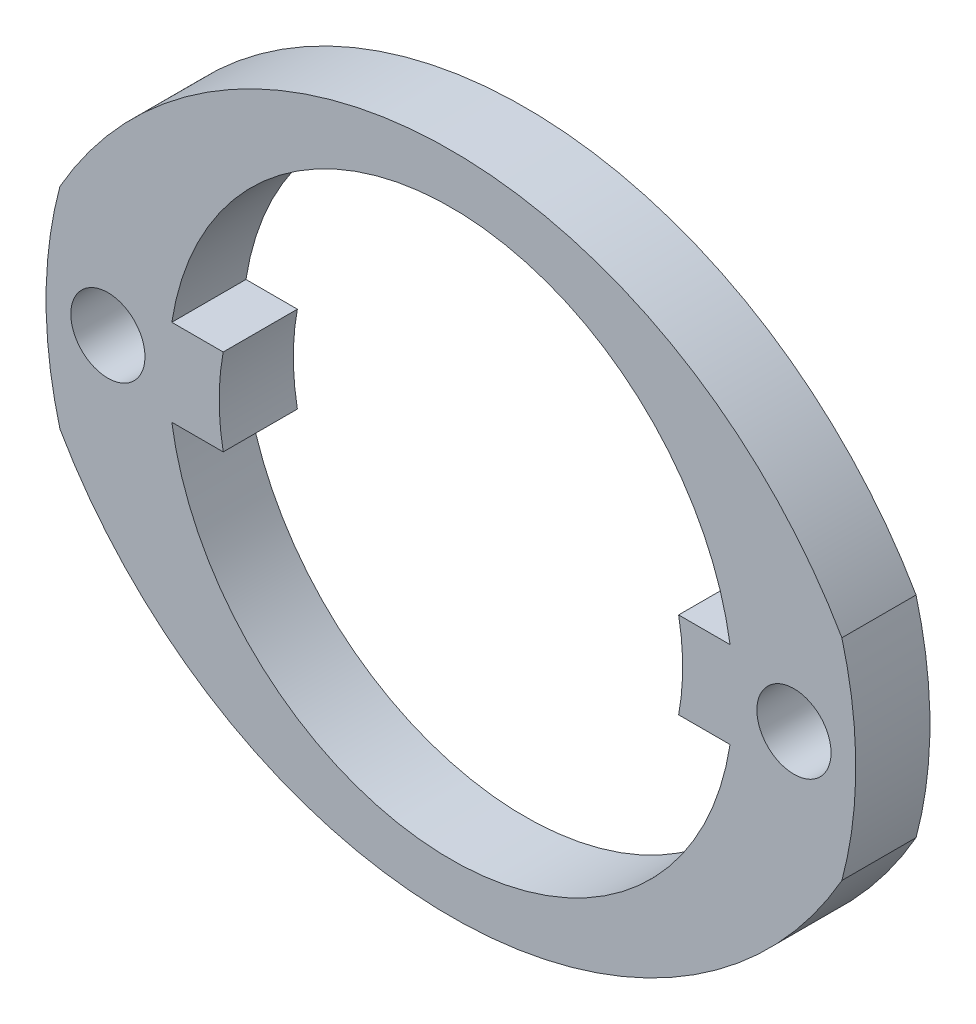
ISO-10303-21;
HEADER;
FILE_DESCRIPTION(('STEP AP214'),'2;1');
FILE_NAME('part.step','',(''),(''),'','','');
FILE_SCHEMA(('AUTOMOTIVE_DESIGN { 1 0 10303 214 1 1 1 1 }'));
ENDSEC;
DATA;
#1=APPLICATION_CONTEXT('core data for automotive mechanical design processes');
#2=APPLICATION_PROTOCOL_DEFINITION('international standard','automotive_design',2000,#1);
#3=PRODUCT_CONTEXT('',#1,'mechanical');
#4=PRODUCT('Part','Part','',(#3));
#5=PRODUCT_RELATED_PRODUCT_CATEGORY('part','',(#4));
#6=PRODUCT_DEFINITION_FORMATION('','',#4);
#7=PRODUCT_DEFINITION_CONTEXT('part definition',#1,'design');
#8=PRODUCT_DEFINITION('design','',#6,#7);
#9=PRODUCT_DEFINITION_SHAPE('','',#8);
#10=(LENGTH_UNIT() NAMED_UNIT(*) SI_UNIT(.MILLI.,.METRE.));
#11=(NAMED_UNIT(*) PLANE_ANGLE_UNIT() SI_UNIT($,.RADIAN.));
#12=(NAMED_UNIT(*) SI_UNIT($,.STERADIAN.) SOLID_ANGLE_UNIT());
#13=UNCERTAINTY_MEASURE_WITH_UNIT(LENGTH_MEASURE(1.E-05),#10,'distance_accuracy_value','');
#14=(GEOMETRIC_REPRESENTATION_CONTEXT(3) GLOBAL_UNCERTAINTY_ASSIGNED_CONTEXT((#13)) GLOBAL_UNIT_ASSIGNED_CONTEXT((#10,
#11,#12)) REPRESENTATION_CONTEXT('',''));
#15=CARTESIAN_POINT('',(0.,0.,0.));
#16=DIRECTION('',(0.,0.,1.));
#17=DIRECTION('',(1.,0.,0.));
#18=AXIS2_PLACEMENT_3D('',#15,#16,#17);
#19=CARTESIAN_POINT('',(-16.7203302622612,-2.16946923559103,3.));
#20=DIRECTION('',(0.,0.,1.));
#21=DIRECTION('',(1.,0.,0.));
#22=AXIS2_PLACEMENT_3D('',#19,#20,#21);
#23=PLANE('',#22);
#24=CARTESIAN_POINT('',(-2.84533026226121,0.225930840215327,3.));
#25=DIRECTION('',(0.,0.,1.));
#26=DIRECTION('',(1.,0.,0.));
#27=AXIS2_PLACEMENT_3D('',#24,#25,#26);
#28=CIRCLE('',#27,1.5);
#29=CARTESIAN_POINT('',(-1.3453302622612,0.225930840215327,3.));
#30=VERTEX_POINT('',#29);
#31=EDGE_CURVE('E202',#30,#30,#28,.T.);
#32=ORIENTED_EDGE('',*,*,#31,.F.);
#33=EDGE_LOOP('',(#32));
#34=FACE_BOUND('',#33,.T.);
#35=CARTESIAN_POINT('',(-16.7203302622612,-4.56486931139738,3.));
#36=DIRECTION('',(0.,0.,1.));
#37=DIRECTION('',(1.,0.,0.));
#38=AXIS2_PLACEMENT_3D('',#35,#36,#37);
#39=CIRCLE('',#38,18.2158001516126);
#40=CARTESIAN_POINT('',(-0.906504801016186,4.47605428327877,3.));
#41=VERTEX_POINT('',#40);
#42=CARTESIAN_POINT('',(-32.5341557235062,4.47605428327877,3.));
#43=VERTEX_POINT('',#42);
#44=EDGE_CURVE('E246',#41,#43,#39,.T.);
#45=ORIENTED_EDGE('',*,*,#44,.T.);
#46=CARTESIAN_POINT('',(-16.7203302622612,0.225930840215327,3.));
#47=DIRECTION('',(0.,0.,1.));
#48=DIRECTION('',(1.,0.,0.));
#49=AXIS2_PLACEMENT_3D('',#46,#47,#48);
#50=CIRCLE('',#49,16.375);
#51=CARTESIAN_POINT('',(-32.5341557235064,-4.0241926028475,3.));
#52=VERTEX_POINT('',#51);
#53=EDGE_CURVE('E250',#43,#52,#50,.T.);
#54=ORIENTED_EDGE('',*,*,#53,.T.);
#55=CARTESIAN_POINT('',(-16.7203302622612,5.01673099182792,3.));
#56=DIRECTION('',(0.,0.,1.));
#57=DIRECTION('',(1.,0.,0.));
#58=AXIS2_PLACEMENT_3D('',#55,#56,#57);
#59=CIRCLE('',#58,18.2158001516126);
#60=CARTESIAN_POINT('',(-0.90650480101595,-4.02419260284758,3.));
#61=VERTEX_POINT('',#60);
#62=EDGE_CURVE('E254',#52,#61,#59,.T.);
#63=ORIENTED_EDGE('',*,*,#62,.T.);
#64=CARTESIAN_POINT('',(-16.7203302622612,0.225930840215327,3.));
#65=DIRECTION('',(0.,0.,1.));
#66=DIRECTION('',(1.,0.,0.));
#67=AXIS2_PLACEMENT_3D('',#64,#65,#66);
#68=CIRCLE('',#67,16.375);
#69=EDGE_CURVE('E257',#61,#41,#68,.T.);
#70=ORIENTED_EDGE('',*,*,#69,.T.);
#71=EDGE_LOOP('',(#45,#54,#63,#70));
#72=FACE_BOUND('',#71,.T.);
#73=DIRECTION('',(-1.,0.,0.));
#74=VECTOR('',#73,1.);
#75=CARTESIAN_POINT('',(-7.51011175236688,-1.52406915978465,3.));
#76=LINE('',#75,#74);
#77=CARTESIAN_POINT('',(-5.43015200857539,-1.52406915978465,3.));
#78=VERTEX_POINT('',#77);
#79=CARTESIAN_POINT('',(-7.51011175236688,-1.52406915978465,3.));
#80=VERTEX_POINT('',#79);
#81=EDGE_CURVE('E162',#78,#80,#76,.T.);
#82=ORIENTED_EDGE('',*,*,#81,.F.);
#83=CARTESIAN_POINT('',(-16.7203302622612,0.225930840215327,3.));
#84=DIRECTION('',(0.,0.,1.));
#85=DIRECTION('',(1.,0.,0.));
#86=AXIS2_PLACEMENT_3D('',#83,#84,#85);
#87=CIRCLE('',#86,11.425);
#88=CARTESIAN_POINT('',(-28.010508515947,-1.52406915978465,3.));
#89=VERTEX_POINT('',#88);
#90=EDGE_CURVE('E153',#89,#78,#87,.T.);
#91=ORIENTED_EDGE('',*,*,#90,.F.);
#92=DIRECTION('',(-1.,0.,0.));
#93=VECTOR('',#92,1.);
#94=CARTESIAN_POINT('',(-28.010508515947,-1.52406915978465,3.));
#95=LINE('',#94,#93);
#96=CARTESIAN_POINT('',(-25.9305487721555,-1.52406915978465,3.));
#97=VERTEX_POINT('',#96);
#98=EDGE_CURVE('E197',#97,#89,#95,.T.);
#99=ORIENTED_EDGE('',*,*,#98,.F.);
#100=CARTESIAN_POINT('',(-16.7203302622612,0.225930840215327,3.));
#101=DIRECTION('',(0.,0.,1.));
#102=DIRECTION('',(1.,0.,0.));
#103=AXIS2_PLACEMENT_3D('',#100,#101,#102);
#104=CIRCLE('',#103,9.375);
#105=CARTESIAN_POINT('',(-25.9305487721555,1.97593084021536,3.));
#106=VERTEX_POINT('',#105);
#107=EDGE_CURVE('E194',#106,#97,#104,.T.);
#108=ORIENTED_EDGE('',*,*,#107,.F.);
#109=DIRECTION('',(1.,0.,0.));
#110=VECTOR('',#109,1.);
#111=CARTESIAN_POINT('',(-28.010508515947,1.97593084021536,3.));
#112=LINE('',#111,#110);
#113=CARTESIAN_POINT('',(-28.010508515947,1.97593084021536,3.));
#114=VERTEX_POINT('',#113);
#115=EDGE_CURVE('E191',#114,#106,#112,.T.);
#116=ORIENTED_EDGE('',*,*,#115,.F.);
#117=CARTESIAN_POINT('',(-16.7203302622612,0.225930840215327,3.));
#118=DIRECTION('',(0.,0.,1.));
#119=DIRECTION('',(1.,0.,0.));
#120=AXIS2_PLACEMENT_3D('',#117,#118,#119);
#121=CIRCLE('',#120,11.425);
#122=CARTESIAN_POINT('',(-5.43015200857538,1.97593084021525,3.));
#123=VERTEX_POINT('',#122);
#124=EDGE_CURVE('E188',#123,#114,#121,.T.);
#125=ORIENTED_EDGE('',*,*,#124,.F.);
#126=DIRECTION('',(1.,0.,0.));
#127=VECTOR('',#126,1.);
#128=CARTESIAN_POINT('',(-7.51011175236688,1.97593084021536,3.));
#129=LINE('',#128,#127);
#130=CARTESIAN_POINT('',(-7.51011175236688,1.97593084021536,3.));
#131=VERTEX_POINT('',#130);
#132=EDGE_CURVE('E182',#131,#123,#129,.T.);
#133=ORIENTED_EDGE('',*,*,#132,.F.);
#134=CARTESIAN_POINT('',(-16.7203302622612,0.225930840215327,3.));
#135=DIRECTION('',(0.,0.,1.));
#136=DIRECTION('',(1.,0.,0.));
#137=AXIS2_PLACEMENT_3D('',#134,#135,#136);
#138=CIRCLE('',#137,9.375);
#139=EDGE_CURVE('E177',#80,#131,#138,.T.);
#140=ORIENTED_EDGE('',*,*,#139,.F.);
#141=EDGE_LOOP('',(#82,#91,#99,#108,#116,#125,#133,#140));
#142=FACE_BOUND('',#141,.T.);
#143=CARTESIAN_POINT('',(-30.5953302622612,0.225930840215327,3.));
#144=DIRECTION('',(0.,0.,1.));
#145=DIRECTION('',(1.,0.,0.));
#146=AXIS2_PLACEMENT_3D('',#143,#144,#145);
#147=CIRCLE('',#146,1.5);
#148=CARTESIAN_POINT('',(-29.0953302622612,0.225930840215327,3.));
#149=VERTEX_POINT('',#148);
#150=EDGE_CURVE('E363',#149,#149,#147,.T.);
#151=ORIENTED_EDGE('',*,*,#150,.F.);
#152=EDGE_LOOP('',(#151));
#153=FACE_BOUND('',#152,.T.);
#154=ADVANCED_FACE('F39',(#34,#72,#142,#153),#23,.T.);
#155=CARTESIAN_POINT('',(-16.7203302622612,-2.16946923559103,0.));
#156=DIRECTION('',(0.,0.,1.));
#157=DIRECTION('',(1.,0.,0.));
#158=AXIS2_PLACEMENT_3D('',#155,#156,#157);
#159=PLANE('',#158);
#160=CARTESIAN_POINT('',(-16.7203302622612,-4.56486931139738,0.));
#161=DIRECTION('',(0.,0.,1.));
#162=DIRECTION('',(1.,0.,0.));
#163=AXIS2_PLACEMENT_3D('',#160,#161,#162);
#164=CIRCLE('',#163,18.2158001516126);
#165=CARTESIAN_POINT('',(-0.906504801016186,4.47605428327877,0.));
#166=VERTEX_POINT('',#165);
#167=CARTESIAN_POINT('',(-32.5341557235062,4.47605428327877,0.));
#168=VERTEX_POINT('',#167);
#169=EDGE_CURVE('E171',#166,#168,#164,.T.);
#170=ORIENTED_EDGE('',*,*,#169,.F.);
#171=CARTESIAN_POINT('',(-16.7203302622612,0.225930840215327,0.));
#172=DIRECTION('',(0.,0.,1.));
#173=DIRECTION('',(1.,0.,0.));
#174=AXIS2_PLACEMENT_3D('',#171,#172,#173);
#175=CIRCLE('',#174,16.375);
#176=CARTESIAN_POINT('',(-0.90650480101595,-4.02419260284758,0.));
#177=VERTEX_POINT('',#176);
#178=EDGE_CURVE('E251',#177,#166,#175,.T.);
#179=ORIENTED_EDGE('',*,*,#178,.F.);
#180=CARTESIAN_POINT('',(-16.7203302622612,5.01673099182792,0.));
#181=DIRECTION('',(0.,0.,1.));
#182=DIRECTION('',(1.,0.,0.));
#183=AXIS2_PLACEMENT_3D('',#180,#181,#182);
#184=CIRCLE('',#183,18.2158001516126);
#185=CARTESIAN_POINT('',(-32.5341557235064,-4.0241926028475,0.));
#186=VERTEX_POINT('',#185);
#187=EDGE_CURVE('E267',#186,#177,#184,.T.);
#188=ORIENTED_EDGE('',*,*,#187,.F.);
#189=CARTESIAN_POINT('',(-16.7203302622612,0.225930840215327,0.));
#190=DIRECTION('',(0.,0.,1.));
#191=DIRECTION('',(1.,0.,0.));
#192=AXIS2_PLACEMENT_3D('',#189,#190,#191);
#193=CIRCLE('',#192,16.375);
#194=EDGE_CURVE('E264',#168,#186,#193,.T.);
#195=ORIENTED_EDGE('',*,*,#194,.F.);
#196=EDGE_LOOP('',(#170,#179,#188,#195));
#197=FACE_BOUND('',#196,.T.);
#198=CARTESIAN_POINT('',(-16.7203302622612,0.225930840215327,0.));
#199=DIRECTION('',(0.,0.,1.));
#200=DIRECTION('',(1.,0.,0.));
#201=AXIS2_PLACEMENT_3D('',#198,#199,#200);
#202=CIRCLE('',#201,11.425);
#203=CARTESIAN_POINT('',(-28.010508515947,-1.52406915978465,0.));
#204=VERTEX_POINT('',#203);
#205=CARTESIAN_POINT('',(-5.43015200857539,-1.52406915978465,0.));
#206=VERTEX_POINT('',#205);
#207=EDGE_CURVE('E68',#204,#206,#202,.T.);
#208=ORIENTED_EDGE('',*,*,#207,.T.);
#209=DIRECTION('',(-1.,0.,0.));
#210=VECTOR('',#209,1.);
#211=CARTESIAN_POINT('',(-7.51011175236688,-1.52406915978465,0.));
#212=LINE('',#211,#210);
#213=CARTESIAN_POINT('',(-7.51011175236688,-1.52406915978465,0.));
#214=VERTEX_POINT('',#213);
#215=EDGE_CURVE('E169',#206,#214,#212,.T.);
#216=ORIENTED_EDGE('',*,*,#215,.T.);
#217=CARTESIAN_POINT('',(-16.7203302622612,0.225930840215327,0.));
#218=DIRECTION('',(0.,0.,1.));
#219=DIRECTION('',(1.,0.,0.));
#220=AXIS2_PLACEMENT_3D('',#217,#218,#219);
#221=CIRCLE('',#220,9.375);
#222=CARTESIAN_POINT('',(-7.51011175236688,1.97593084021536,0.));
#223=VERTEX_POINT('',#222);
#224=EDGE_CURVE('E205',#214,#223,#221,.T.);
#225=ORIENTED_EDGE('',*,*,#224,.T.);
#226=DIRECTION('',(1.,0.,0.));
#227=VECTOR('',#226,1.);
#228=CARTESIAN_POINT('',(-7.51011175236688,1.97593084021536,0.));
#229=LINE('',#228,#227);
#230=CARTESIAN_POINT('',(-5.43015200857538,1.97593084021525,0.));
#231=VERTEX_POINT('',#230);
#232=EDGE_CURVE('E209',#223,#231,#229,.T.);
#233=ORIENTED_EDGE('',*,*,#232,.T.);
#234=CARTESIAN_POINT('',(-16.7203302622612,0.225930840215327,0.));
#235=DIRECTION('',(0.,0.,1.));
#236=DIRECTION('',(1.,0.,0.));
#237=AXIS2_PLACEMENT_3D('',#234,#235,#236);
#238=CIRCLE('',#237,11.425);
#239=CARTESIAN_POINT('',(-28.010508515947,1.97593084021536,0.));
#240=VERTEX_POINT('',#239);
#241=EDGE_CURVE('E213',#231,#240,#238,.T.);
#242=ORIENTED_EDGE('',*,*,#241,.T.);
#243=DIRECTION('',(1.,0.,0.));
#244=VECTOR('',#243,1.);
#245=CARTESIAN_POINT('',(-28.010508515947,1.97593084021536,0.));
#246=LINE('',#245,#244);
#247=CARTESIAN_POINT('',(-25.9305487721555,1.97593084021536,0.));
#248=VERTEX_POINT('',#247);
#249=EDGE_CURVE('E217',#240,#248,#246,.T.);
#250=ORIENTED_EDGE('',*,*,#249,.T.);
#251=CARTESIAN_POINT('',(-16.7203302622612,0.225930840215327,0.));
#252=DIRECTION('',(0.,0.,1.));
#253=DIRECTION('',(1.,0.,0.));
#254=AXIS2_PLACEMENT_3D('',#251,#252,#253);
#255=CIRCLE('',#254,9.375);
#256=CARTESIAN_POINT('',(-25.9305487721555,-1.52406915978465,0.));
#257=VERTEX_POINT('',#256);
#258=EDGE_CURVE('E221',#248,#257,#255,.T.);
#259=ORIENTED_EDGE('',*,*,#258,.T.);
#260=DIRECTION('',(-1.,0.,0.));
#261=VECTOR('',#260,1.);
#262=CARTESIAN_POINT('',(-28.010508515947,-1.52406915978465,0.));
#263=LINE('',#262,#261);
#264=EDGE_CURVE('E163',#257,#204,#263,.T.);
#265=ORIENTED_EDGE('',*,*,#264,.T.);
#266=EDGE_LOOP('',(#208,#216,#225,#233,#242,#250,#259,#265));
#267=FACE_BOUND('',#266,.T.);
#268=CARTESIAN_POINT('',(-2.84533026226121,0.225930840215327,0.));
#269=DIRECTION('',(0.,0.,1.));
#270=DIRECTION('',(1.,0.,0.));
#271=AXIS2_PLACEMENT_3D('',#268,#269,#270);
#272=CIRCLE('',#271,1.5);
#273=CARTESIAN_POINT('',(-1.3453302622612,0.225930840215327,0.));
#274=VERTEX_POINT('',#273);
#275=EDGE_CURVE('E371',#274,#274,#272,.T.);
#276=ORIENTED_EDGE('',*,*,#275,.T.);
#277=EDGE_LOOP('',(#276));
#278=FACE_BOUND('',#277,.T.);
#279=CARTESIAN_POINT('',(-30.5953302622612,0.225930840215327,0.));
#280=DIRECTION('',(0.,0.,1.));
#281=DIRECTION('',(1.,0.,0.));
#282=AXIS2_PLACEMENT_3D('',#279,#280,#281);
#283=CIRCLE('',#282,1.5);
#284=CARTESIAN_POINT('',(-29.0953302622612,0.225930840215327,0.));
#285=VERTEX_POINT('',#284);
#286=EDGE_CURVE('E366',#285,#285,#283,.T.);
#287=ORIENTED_EDGE('',*,*,#286,.T.);
#288=EDGE_LOOP('',(#287));
#289=FACE_BOUND('',#288,.T.);
#290=ADVANCED_FACE('F290',(#197,#267,#278,#289),#159,.F.);
#291=CARTESIAN_POINT('',(-16.7203302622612,-4.56486931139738,3.));
#292=DIRECTION('',(0.,0.,-1.));
#293=DIRECTION('',(-1.,0.,0.));
#294=AXIS2_PLACEMENT_3D('',#291,#292,#293);
#295=CYLINDRICAL_SURFACE('',#294,18.2158001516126);
#296=ORIENTED_EDGE('',*,*,#169,.T.);
#297=DIRECTION('',(0.,0.,-1.));
#298=VECTOR('',#297,1.);
#299=CARTESIAN_POINT('',(-32.5341557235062,4.47605428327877,3.));
#300=LINE('',#299,#298);
#301=EDGE_CURVE('E11',#43,#168,#300,.T.);
#302=ORIENTED_EDGE('',*,*,#301,.F.);
#303=ORIENTED_EDGE('',*,*,#44,.F.);
#304=DIRECTION('',(0.,0.,-1.));
#305=VECTOR('',#304,1.);
#306=CARTESIAN_POINT('',(-0.906504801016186,4.47605428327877,3.));
#307=LINE('',#306,#305);
#308=EDGE_CURVE('E260',#41,#166,#307,.T.);
#309=ORIENTED_EDGE('',*,*,#308,.T.);
#310=EDGE_LOOP('',(#296,#302,#303,#309));
#311=FACE_BOUND('',#310,.T.);
#312=ADVANCED_FACE('F41',(#311),#295,.T.);
#313=CARTESIAN_POINT('',(-16.7203302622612,0.225930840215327,3.));
#314=DIRECTION('',(0.,0.,-1.));
#315=DIRECTION('',(-1.,0.,0.));
#316=AXIS2_PLACEMENT_3D('',#313,#314,#315);
#317=CYLINDRICAL_SURFACE('',#316,16.375);
#318=ORIENTED_EDGE('',*,*,#194,.T.);
#319=DIRECTION('',(0.,0.,-1.));
#320=VECTOR('',#319,1.);
#321=CARTESIAN_POINT('',(-32.5341557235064,-4.0241926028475,3.));
#322=LINE('',#321,#320);
#323=EDGE_CURVE('E48',#52,#186,#322,.T.);
#324=ORIENTED_EDGE('',*,*,#323,.F.);
#325=ORIENTED_EDGE('',*,*,#53,.F.);
#326=ORIENTED_EDGE('',*,*,#301,.T.);
#327=EDGE_LOOP('',(#318,#324,#325,#326));
#328=FACE_BOUND('',#327,.T.);
#329=ADVANCED_FACE('F300',(#328),#317,.T.);
#330=CARTESIAN_POINT('',(-16.7203302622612,5.01673099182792,3.));
#331=DIRECTION('',(0.,0.,-1.));
#332=DIRECTION('',(-1.,0.,0.));
#333=AXIS2_PLACEMENT_3D('',#330,#331,#332);
#334=CYLINDRICAL_SURFACE('',#333,18.2158001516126);
#335=ORIENTED_EDGE('',*,*,#187,.T.);
#336=DIRECTION('',(0.,0.,-1.));
#337=VECTOR('',#336,1.);
#338=CARTESIAN_POINT('',(-0.90650480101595,-4.02419260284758,3.));
#339=LINE('',#338,#337);
#340=EDGE_CURVE('E275',#61,#177,#339,.T.);
#341=ORIENTED_EDGE('',*,*,#340,.F.);
#342=ORIENTED_EDGE('',*,*,#62,.F.);
#343=ORIENTED_EDGE('',*,*,#323,.T.);
#344=EDGE_LOOP('',(#335,#341,#342,#343));
#345=FACE_BOUND('',#344,.T.);
#346=ADVANCED_FACE('F284',(#345),#334,.T.);
#347=CARTESIAN_POINT('',(-16.7203302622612,0.225930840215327,3.));
#348=DIRECTION('',(0.,0.,-1.));
#349=DIRECTION('',(-1.,0.,0.));
#350=AXIS2_PLACEMENT_3D('',#347,#348,#349);
#351=CYLINDRICAL_SURFACE('',#350,16.375);
#352=ORIENTED_EDGE('',*,*,#178,.T.);
#353=ORIENTED_EDGE('',*,*,#308,.F.);
#354=ORIENTED_EDGE('',*,*,#69,.F.);
#355=ORIENTED_EDGE('',*,*,#340,.T.);
#356=EDGE_LOOP('',(#352,#353,#354,#355));
#357=FACE_BOUND('',#356,.T.);
#358=ADVANCED_FACE('F294',(#357),#351,.T.);
#359=CARTESIAN_POINT('',(-16.7203302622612,0.225930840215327,3.));
#360=DIRECTION('',(0.,0.,-1.));
#361=DIRECTION('',(-1.,0.,0.));
#362=AXIS2_PLACEMENT_3D('',#359,#360,#361);
#363=CYLINDRICAL_SURFACE('',#362,11.425);
#364=ORIENTED_EDGE('',*,*,#207,.F.);
#365=DIRECTION('',(0.,0.,-1.));
#366=VECTOR('',#365,1.);
#367=CARTESIAN_POINT('',(-28.010508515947,-1.52406915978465,3.));
#368=LINE('',#367,#366);
#369=EDGE_CURVE('E157',#89,#204,#368,.T.);
#370=ORIENTED_EDGE('',*,*,#369,.F.);
#371=ORIENTED_EDGE('',*,*,#90,.T.);
#372=DIRECTION('',(0.,0.,-1.));
#373=VECTOR('',#372,1.);
#374=CARTESIAN_POINT('',(-5.43015200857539,-1.52406915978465,3.));
#375=LINE('',#374,#373);
#376=EDGE_CURVE('E156',#78,#206,#375,.T.);
#377=ORIENTED_EDGE('',*,*,#376,.T.);
#378=EDGE_LOOP('',(#364,#370,#371,#377));
#379=FACE_BOUND('',#378,.T.);
#380=ADVANCED_FACE('F155',(#379),#363,.F.);
#381=CARTESIAN_POINT('',(-7.51011175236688,-1.52406915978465,3.));
#382=DIRECTION('',(0.,-1.,0.));
#383=DIRECTION('',(0.,0.,-1.));
#384=AXIS2_PLACEMENT_3D('',#381,#382,#383);
#385=PLANE('',#384);
#386=ORIENTED_EDGE('',*,*,#215,.F.);
#387=ORIENTED_EDGE('',*,*,#376,.F.);
#388=ORIENTED_EDGE('',*,*,#81,.T.);
#389=DIRECTION('',(0.,0.,-1.));
#390=VECTOR('',#389,1.);
#391=CARTESIAN_POINT('',(-7.51011175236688,-1.52406915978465,3.));
#392=LINE('',#391,#390);
#393=EDGE_CURVE('E172',#80,#214,#392,.T.);
#394=ORIENTED_EDGE('',*,*,#393,.T.);
#395=EDGE_LOOP('',(#386,#387,#388,#394));
#396=FACE_BOUND('',#395,.T.);
#397=ADVANCED_FACE('F166',(#396),#385,.T.);
#398=CARTESIAN_POINT('',(-16.7203302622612,0.225930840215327,3.));
#399=DIRECTION('',(0.,0.,-1.));
#400=DIRECTION('',(-1.,0.,0.));
#401=AXIS2_PLACEMENT_3D('',#398,#399,#400);
#402=CYLINDRICAL_SURFACE('',#401,9.375);
#403=ORIENTED_EDGE('',*,*,#224,.F.);
#404=ORIENTED_EDGE('',*,*,#393,.F.);
#405=ORIENTED_EDGE('',*,*,#139,.T.);
#406=DIRECTION('',(0.,0.,-1.));
#407=VECTOR('',#406,1.);
#408=CARTESIAN_POINT('',(-7.51011175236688,1.97593084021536,3.));
#409=LINE('',#408,#407);
#410=EDGE_CURVE('E241',#131,#223,#409,.T.);
#411=ORIENTED_EDGE('',*,*,#410,.T.);
#412=EDGE_LOOP('',(#403,#404,#405,#411));
#413=FACE_BOUND('',#412,.T.);
#414=ADVANCED_FACE('F325',(#413),#402,.F.);
#415=CARTESIAN_POINT('',(-7.51011175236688,1.97593084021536,3.));
#416=DIRECTION('',(0.,1.,0.));
#417=DIRECTION('',(-1.,0.,0.));
#418=AXIS2_PLACEMENT_3D('',#415,#416,#417);
#419=PLANE('',#418);
#420=ORIENTED_EDGE('',*,*,#232,.F.);
#421=ORIENTED_EDGE('',*,*,#410,.F.);
#422=ORIENTED_EDGE('',*,*,#132,.T.);
#423=DIRECTION('',(0.,0.,-1.));
#424=VECTOR('',#423,1.);
#425=CARTESIAN_POINT('',(-5.43015200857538,1.97593084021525,3.));
#426=LINE('',#425,#424);
#427=EDGE_CURVE('E238',#123,#231,#426,.T.);
#428=ORIENTED_EDGE('',*,*,#427,.T.);
#429=EDGE_LOOP('',(#420,#421,#422,#428));
#430=FACE_BOUND('',#429,.T.);
#431=ADVANCED_FACE('F329',(#430),#419,.T.);
#432=CARTESIAN_POINT('',(-16.7203302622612,0.225930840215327,3.));
#433=DIRECTION('',(0.,0.,-1.));
#434=DIRECTION('',(-1.,0.,0.));
#435=AXIS2_PLACEMENT_3D('',#432,#433,#434);
#436=CYLINDRICAL_SURFACE('',#435,11.425);
#437=ORIENTED_EDGE('',*,*,#241,.F.);
#438=ORIENTED_EDGE('',*,*,#427,.F.);
#439=ORIENTED_EDGE('',*,*,#124,.T.);
#440=DIRECTION('',(0.,0.,-1.));
#441=VECTOR('',#440,1.);
#442=CARTESIAN_POINT('',(-28.010508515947,1.97593084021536,3.));
#443=LINE('',#442,#441);
#444=EDGE_CURVE('E235',#114,#240,#443,.T.);
#445=ORIENTED_EDGE('',*,*,#444,.T.);
#446=EDGE_LOOP('',(#437,#438,#439,#445));
#447=FACE_BOUND('',#446,.T.);
#448=ADVANCED_FACE('F335',(#447),#436,.F.);
#449=CARTESIAN_POINT('',(-28.010508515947,1.97593084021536,3.));
#450=DIRECTION('',(0.,1.,0.));
#451=DIRECTION('',(0.,0.,1.));
#452=AXIS2_PLACEMENT_3D('',#449,#450,#451);
#453=PLANE('',#452);
#454=ORIENTED_EDGE('',*,*,#249,.F.);
#455=ORIENTED_EDGE('',*,*,#444,.F.);
#456=ORIENTED_EDGE('',*,*,#115,.T.);
#457=DIRECTION('',(0.,0.,-1.));
#458=VECTOR('',#457,1.);
#459=CARTESIAN_POINT('',(-25.9305487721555,1.97593084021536,3.));
#460=LINE('',#459,#458);
#461=EDGE_CURVE('E232',#106,#248,#460,.T.);
#462=ORIENTED_EDGE('',*,*,#461,.T.);
#463=EDGE_LOOP('',(#454,#455,#456,#462));
#464=FACE_BOUND('',#463,.T.);
#465=ADVANCED_FACE('F339',(#464),#453,.T.);
#466=CARTESIAN_POINT('',(-16.7203302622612,0.225930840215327,3.));
#467=DIRECTION('',(0.,0.,-1.));
#468=DIRECTION('',(-1.,0.,0.));
#469=AXIS2_PLACEMENT_3D('',#466,#467,#468);
#470=CYLINDRICAL_SURFACE('',#469,9.375);
#471=ORIENTED_EDGE('',*,*,#258,.F.);
#472=ORIENTED_EDGE('',*,*,#461,.F.);
#473=ORIENTED_EDGE('',*,*,#107,.T.);
#474=DIRECTION('',(0.,0.,-1.));
#475=VECTOR('',#474,1.);
#476=CARTESIAN_POINT('',(-25.9305487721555,-1.52406915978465,3.));
#477=LINE('',#476,#475);
#478=EDGE_CURVE('E58',#97,#257,#477,.T.);
#479=ORIENTED_EDGE('',*,*,#478,.T.);
#480=EDGE_LOOP('',(#471,#472,#473,#479));
#481=FACE_BOUND('',#480,.T.);
#482=ADVANCED_FACE('F343',(#481),#470,.F.);
#483=CARTESIAN_POINT('',(-28.010508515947,-1.52406915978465,3.));
#484=DIRECTION('',(0.,-1.,0.));
#485=DIRECTION('',(0.,0.,-1.));
#486=AXIS2_PLACEMENT_3D('',#483,#484,#485);
#487=PLANE('',#486);
#488=ORIENTED_EDGE('',*,*,#264,.F.);
#489=ORIENTED_EDGE('',*,*,#478,.F.);
#490=ORIENTED_EDGE('',*,*,#98,.T.);
#491=ORIENTED_EDGE('',*,*,#369,.T.);
#492=EDGE_LOOP('',(#488,#489,#490,#491));
#493=FACE_BOUND('',#492,.T.);
#494=ADVANCED_FACE('F347',(#493),#487,.T.);
#495=CARTESIAN_POINT('',(-2.84533026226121,0.225930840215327,3.));
#496=DIRECTION('',(0.,0.,-1.));
#497=DIRECTION('',(-1.,0.,0.));
#498=AXIS2_PLACEMENT_3D('',#495,#496,#497);
#499=CYLINDRICAL_SURFACE('',#498,1.5);
#500=ORIENTED_EDGE('',*,*,#31,.T.);
#501=EDGE_LOOP('',(#500));
#502=FACE_BOUND('',#501,.T.);
#503=ORIENTED_EDGE('',*,*,#275,.F.);
#504=EDGE_LOOP('',(#503));
#505=FACE_BOUND('',#504,.T.);
#506=ADVANCED_FACE('F351',(#502,#505),#499,.F.);
#507=CARTESIAN_POINT('',(-30.5953302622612,0.225930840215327,3.));
#508=DIRECTION('',(0.,0.,-1.));
#509=DIRECTION('',(-1.,0.,0.));
#510=AXIS2_PLACEMENT_3D('',#507,#508,#509);
#511=CYLINDRICAL_SURFACE('',#510,1.5);
#512=ORIENTED_EDGE('',*,*,#150,.T.);
#513=EDGE_LOOP('',(#512));
#514=FACE_BOUND('',#513,.T.);
#515=ORIENTED_EDGE('',*,*,#286,.F.);
#516=EDGE_LOOP('',(#515));
#517=FACE_BOUND('',#516,.T.);
#518=ADVANCED_FACE('F354',(#514,#517),#511,.F.);
#519=CLOSED_SHELL('',(#154,#290,#312,#329,#346,#358,#380,#397,#414,#431,#448,#465,#482,#494,
#506,#518));
#520=MANIFOLD_SOLID_BREP('B2',#519);
#521=ADVANCED_BREP_SHAPE_REPRESENTATION('',(#18,#520),#14);
#522=SHAPE_DEFINITION_REPRESENTATION(#9,#521);
ENDSEC;
END-ISO-10303-21;
